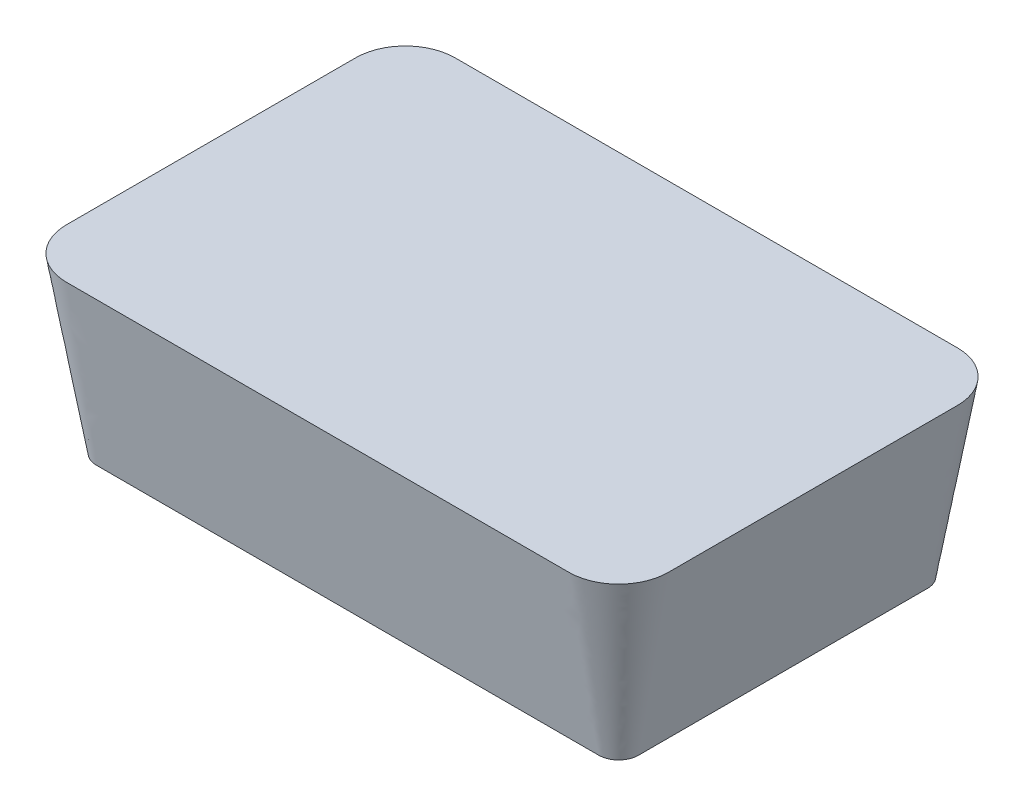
ISO-10303-21;
HEADER;
FILE_DESCRIPTION(('STEP AP214'),'2;1');
FILE_NAME('part.step','',(''),(''),'','','');
FILE_SCHEMA(('AUTOMOTIVE_DESIGN { 1 0 10303 214 1 1 1 1 }'));
ENDSEC;
DATA;
#1=APPLICATION_CONTEXT('core data for automotive mechanical design processes');
#2=APPLICATION_PROTOCOL_DEFINITION('international standard','automotive_design',2000,#1);
#3=PRODUCT_CONTEXT('',#1,'mechanical');
#4=PRODUCT('Part','Part','',(#3));
#5=PRODUCT_RELATED_PRODUCT_CATEGORY('part','',(#4));
#6=PRODUCT_DEFINITION_FORMATION('','',#4);
#7=PRODUCT_DEFINITION_CONTEXT('part definition',#1,'design');
#8=PRODUCT_DEFINITION('design','',#6,#7);
#9=PRODUCT_DEFINITION_SHAPE('','',#8);
#10=(LENGTH_UNIT() NAMED_UNIT(*) SI_UNIT(.MILLI.,.METRE.));
#11=(NAMED_UNIT(*) PLANE_ANGLE_UNIT() SI_UNIT($,.RADIAN.));
#12=(NAMED_UNIT(*) SI_UNIT($,.STERADIAN.) SOLID_ANGLE_UNIT());
#13=UNCERTAINTY_MEASURE_WITH_UNIT(LENGTH_MEASURE(1.E-05),#10,'distance_accuracy_value','');
#14=(GEOMETRIC_REPRESENTATION_CONTEXT(3) GLOBAL_UNCERTAINTY_ASSIGNED_CONTEXT((#13)) GLOBAL_UNIT_ASSIGNED_CONTEXT((#10,
#11,#12)) REPRESENTATION_CONTEXT('',''));
#15=CARTESIAN_POINT('',(0.,0.,0.));
#16=DIRECTION('',(0.,0.,1.));
#17=DIRECTION('',(1.,0.,0.));
#18=AXIS2_PLACEMENT_3D('',#15,#16,#17);
#19=CARTESIAN_POINT('',(160.02,0.,-92.075));
#20=DIRECTION('',(0.,1.,0.));
#21=DIRECTION('',(0.,0.,1.));
#22=AXIS2_PLACEMENT_3D('',#19,#20,#21);
#23=PLANE('',#22);
#24=CARTESIAN_POINT('',(160.02,0.,-92.075));
#25=DIRECTION('',(0.,1.,0.));
#26=DIRECTION('',(0.,0.,1.));
#27=AXIS2_PLACEMENT_3D('',#24,#25,#26);
#28=CIRCLE('',#27,12.7);
#29=CARTESIAN_POINT('',(172.72,0.,-92.0749999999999));
#30=VERTEX_POINT('',#29);
#31=CARTESIAN_POINT('',(160.02,0.,-104.775));
#32=VERTEX_POINT('',#31);
#33=EDGE_CURVE('E313',#30,#32,#28,.T.);
#34=ORIENTED_EDGE('',*,*,#33,.F.);
#35=DIRECTION('',(0.,0.,-1.));
#36=VECTOR('',#35,1.);
#37=CARTESIAN_POINT('',(172.72,0.,92.0749999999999));
#38=LINE('',#37,#36);
#39=CARTESIAN_POINT('',(172.72,0.,92.0749999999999));
#40=VERTEX_POINT('',#39);
#41=EDGE_CURVE('E12',#40,#30,#38,.T.);
#42=ORIENTED_EDGE('',*,*,#41,.F.);
#43=CARTESIAN_POINT('',(160.02,0.,92.075));
#44=DIRECTION('',(0.,1.,0.));
#45=DIRECTION('',(0.,0.,1.));
#46=AXIS2_PLACEMENT_3D('',#43,#44,#45);
#47=CIRCLE('',#46,12.7);
#48=CARTESIAN_POINT('',(160.02,0.,104.775));
#49=VERTEX_POINT('',#48);
#50=EDGE_CURVE('E242',#49,#40,#47,.T.);
#51=ORIENTED_EDGE('',*,*,#50,.F.);
#52=DIRECTION('',(1.,0.,0.));
#53=VECTOR('',#52,1.);
#54=CARTESIAN_POINT('',(160.02,0.,104.775));
#55=LINE('',#54,#53);
#56=CARTESIAN_POINT('',(-160.02,0.,104.775));
#57=VERTEX_POINT('',#56);
#58=EDGE_CURVE('E449',#57,#49,#55,.T.);
#59=ORIENTED_EDGE('',*,*,#58,.F.);
#60=CARTESIAN_POINT('',(-160.02,0.,92.075));
#61=DIRECTION('',(0.,1.,0.));
#62=DIRECTION('',(0.,0.,-1.));
#63=AXIS2_PLACEMENT_3D('',#60,#61,#62);
#64=CIRCLE('',#63,12.7);
#65=CARTESIAN_POINT('',(-172.72,0.,92.0749999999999));
#66=VERTEX_POINT('',#65);
#67=EDGE_CURVE('E460',#66,#57,#64,.T.);
#68=ORIENTED_EDGE('',*,*,#67,.F.);
#69=DIRECTION('',(0.,0.,1.));
#70=VECTOR('',#69,1.);
#71=CARTESIAN_POINT('',(-172.72,0.,92.0749999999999));
#72=LINE('',#71,#70);
#73=CARTESIAN_POINT('',(-172.72,0.,-92.0749999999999));
#74=VERTEX_POINT('',#73);
#75=EDGE_CURVE('E470',#74,#66,#72,.T.);
#76=ORIENTED_EDGE('',*,*,#75,.F.);
#77=CARTESIAN_POINT('',(-160.02,0.,-92.075));
#78=DIRECTION('',(0.,1.,0.));
#79=DIRECTION('',(0.,0.,1.));
#80=AXIS2_PLACEMENT_3D('',#77,#78,#79);
#81=CIRCLE('',#80,12.7);
#82=CARTESIAN_POINT('',(-160.02,0.,-104.775));
#83=VERTEX_POINT('',#82);
#84=EDGE_CURVE('E256',#83,#74,#81,.T.);
#85=ORIENTED_EDGE('',*,*,#84,.F.);
#86=DIRECTION('',(-1.,0.,0.));
#87=VECTOR('',#86,1.);
#88=CARTESIAN_POINT('',(160.02,0.,-104.775));
#89=LINE('',#88,#87);
#90=EDGE_CURVE('E250',#32,#83,#89,.T.);
#91=ORIENTED_EDGE('',*,*,#90,.F.);
#92=EDGE_LOOP('',(#34,#42,#51,#59,#68,#76,#85,#91));
#93=FACE_BOUND('',#92,.T.);
#94=ADVANCED_FACE('F231',(#93),#23,.F.);
#95=CARTESIAN_POINT('',(160.02,110.49,92.075));
#96=DIRECTION('',(0.,1.,0.));
#97=DIRECTION('',(0.,0.,1.));
#98=AXIS2_PLACEMENT_3D('',#95,#96,#97);
#99=PLANE('',#98);
#100=CARTESIAN_POINT('',(160.02,110.49,92.075));
#101=DIRECTION('',(0.,1.,0.));
#102=DIRECTION('',(0.,0.,1.));
#103=AXIS2_PLACEMENT_3D('',#100,#101,#102);
#104=CIRCLE('',#103,31.75);
#105=CARTESIAN_POINT('',(160.02,110.49,123.825));
#106=VERTEX_POINT('',#105);
#107=CARTESIAN_POINT('',(191.77,110.49,92.0749999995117));
#108=VERTEX_POINT('',#107);
#109=EDGE_CURVE('E308',#106,#108,#104,.T.);
#110=ORIENTED_EDGE('',*,*,#109,.T.);
#111=DIRECTION('',(0.,0.,-1.));
#112=VECTOR('',#111,1.);
#113=CARTESIAN_POINT('',(191.77,110.49,92.0749999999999));
#114=LINE('',#113,#112);
#115=CARTESIAN_POINT('',(191.77,110.49,-92.0749999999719));
#116=VERTEX_POINT('',#115);
#117=EDGE_CURVE('E379',#108,#116,#114,.T.);
#118=ORIENTED_EDGE('',*,*,#117,.T.);
#119=CARTESIAN_POINT('',(160.02,110.49,-92.075));
#120=DIRECTION('',(0.,1.,0.));
#121=DIRECTION('',(0.,0.,1.));
#122=AXIS2_PLACEMENT_3D('',#119,#120,#121);
#123=CIRCLE('',#122,31.75);
#124=CARTESIAN_POINT('',(160.020000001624,110.49,-123.825));
#125=VERTEX_POINT('',#124);
#126=EDGE_CURVE('E387',#116,#125,#123,.T.);
#127=ORIENTED_EDGE('',*,*,#126,.T.);
#128=DIRECTION('',(-1.,0.,0.));
#129=VECTOR('',#128,1.);
#130=CARTESIAN_POINT('',(160.02,110.49,-123.825));
#131=LINE('',#130,#129);
#132=CARTESIAN_POINT('',(-160.019999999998,110.49,-123.825));
#133=VERTEX_POINT('',#132);
#134=EDGE_CURVE('E392',#125,#133,#131,.T.);
#135=ORIENTED_EDGE('',*,*,#134,.T.);
#136=CARTESIAN_POINT('',(-160.02,110.49,-92.075));
#137=DIRECTION('',(0.,1.,0.));
#138=DIRECTION('',(0.,0.,1.));
#139=AXIS2_PLACEMENT_3D('',#136,#137,#138);
#140=CIRCLE('',#139,31.75);
#141=CARTESIAN_POINT('',(-191.77,110.49,-92.0749999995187));
#142=VERTEX_POINT('',#141);
#143=EDGE_CURVE('E627',#133,#142,#140,.T.);
#144=ORIENTED_EDGE('',*,*,#143,.T.);
#145=DIRECTION('',(0.,0.,1.));
#146=VECTOR('',#145,1.);
#147=CARTESIAN_POINT('',(-191.77,110.49,-92.0749999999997));
#148=LINE('',#147,#146);
#149=CARTESIAN_POINT('',(-191.77,110.49,92.0749999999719));
#150=VERTEX_POINT('',#149);
#151=EDGE_CURVE('E319',#142,#150,#148,.T.);
#152=ORIENTED_EDGE('',*,*,#151,.T.);
#153=CARTESIAN_POINT('',(-160.02,110.49,92.075));
#154=DIRECTION('',(0.,1.,0.));
#155=DIRECTION('',(0.,0.,1.));
#156=AXIS2_PLACEMENT_3D('',#153,#154,#155);
#157=CIRCLE('',#156,31.75);
#158=CARTESIAN_POINT('',(-160.02,110.49,123.825));
#159=VERTEX_POINT('',#158);
#160=EDGE_CURVE('E304',#150,#159,#157,.T.);
#161=ORIENTED_EDGE('',*,*,#160,.T.);
#162=DIRECTION('',(1.,0.,0.));
#163=VECTOR('',#162,1.);
#164=CARTESIAN_POINT('',(-160.02,110.49,123.825));
#165=LINE('',#164,#163);
#166=EDGE_CURVE('E299',#159,#106,#165,.T.);
#167=ORIENTED_EDGE('',*,*,#166,.T.);
#168=EDGE_LOOP('',(#110,#118,#127,#135,#144,#152,#161,#167));
#169=FACE_BOUND('',#168,.T.);
#170=ADVANCED_FACE('F317',(#169),#99,.T.);
#171=CARTESIAN_POINT('',(191.77,110.49,92.0749999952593));
#172=CARTESIAN_POINT('',(172.72,0.,92.0749999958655));
#173=CARTESIAN_POINT('',(191.77,110.49,92.8373417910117));
#174=CARTESIAN_POINT('',(172.72,0.,92.7398638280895));
#175=CARTESIAN_POINT('',(191.716143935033,110.49,94.4198494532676));
#176=CARTESIAN_POINT('',(172.624183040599,0.,93.8495563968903));
#177=CARTESIAN_POINT('',(191.426848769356,110.49,96.9754798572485));
#178=CARTESIAN_POINT('',(172.34369748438,0.,95.2416114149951));
#179=CARTESIAN_POINT('',(190.882099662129,110.49,99.721375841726));
#180=CARTESIAN_POINT('',(171.962416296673,0.,96.4507089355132));
#181=CARTESIAN_POINT('',(190.017159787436,110.49,102.636329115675));
#182=CARTESIAN_POINT('',(171.504375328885,0.,97.5380126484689));
#183=CARTESIAN_POINT('',(188.767292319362,110.49,105.699131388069));
#184=CARTESIAN_POINT('',(170.977903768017,0.,98.5255682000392));
#185=CARTESIAN_POINT('',(187.074106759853,110.49,108.826216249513));
#186=CARTESIAN_POINT('',(170.38976425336,0.,99.4330387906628));
#187=CARTESIAN_POINT('',(184.9138243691,110.49,111.906253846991));
#188=CARTESIAN_POINT('',(169.741719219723,0.,100.269105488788));
#189=CARTESIAN_POINT('',(182.325526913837,110.49,114.780185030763));
#190=CARTESIAN_POINT('',(169.034508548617,0.,101.041314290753));
#191=CARTESIAN_POINT('',(179.423353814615,110.49,117.301459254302));
#192=CARTESIAN_POINT('',(168.265804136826,0.,101.752923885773));
#193=CARTESIAN_POINT('',(176.360302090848,110.49,119.375837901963));
#194=CARTESIAN_POINT('',(167.432286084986,0.,102.406140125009));
#195=CARTESIAN_POINT('',(173.284945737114,110.49,120.986265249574));
#196=CARTESIAN_POINT('',(166.526005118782,0.,103.000125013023));
#197=CARTESIAN_POINT('',(170.294329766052,110.49,122.168449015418));
#198=CARTESIAN_POINT('',(165.538254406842,0.,103.533144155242));
#199=CARTESIAN_POINT('',(167.457078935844,110.49,122.98564288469));
#200=CARTESIAN_POINT('',(164.448117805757,0.,103.998181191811));
#201=CARTESIAN_POINT('',(164.788306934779,110.49,123.500040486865));
#202=CARTESIAN_POINT('',(163.233466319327,0.,104.387094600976));
#203=CARTESIAN_POINT('',(162.303127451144,110.49,123.773835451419));
#204=CARTESIAN_POINT('',(161.828355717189,0.,104.674813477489));
#205=CARTESIAN_POINT('',(160.762666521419,110.49,123.825));
#206=CARTESIAN_POINT('',(160.702589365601,0.,104.775));
#207=CARTESIAN_POINT('',(132.164600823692,110.49,123.825));
#208=CARTESIAN_POINT('',(134.417931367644,0.,104.775));
#209=CARTESIAN_POINT('',(78.3436852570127,110.49,123.825));
#210=CARTESIAN_POINT('',(81.7109541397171,0.,104.775));
#211=CARTESIAN_POINT('',(0.,110.49,123.825));
#212=CARTESIAN_POINT('',(0.,0.,104.775));
#213=CARTESIAN_POINT('',(-78.3436852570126,110.49,123.825));
#214=CARTESIAN_POINT('',(-81.7109541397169,0.,104.775));
#215=CARTESIAN_POINT('',(-132.164600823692,110.49,123.825));
#216=CARTESIAN_POINT('',(-134.417931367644,0.,104.775));
#217=CARTESIAN_POINT('',(-160.762666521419,110.49,123.825));
#218=CARTESIAN_POINT('',(-160.702589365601,0.,104.775));
#219=CARTESIAN_POINT('',(-162.303127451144,110.49,123.773835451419));
#220=CARTESIAN_POINT('',(-161.828355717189,0.,104.674813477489));
#221=CARTESIAN_POINT('',(-164.788306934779,110.49,123.500040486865));
#222=CARTESIAN_POINT('',(-163.233466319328,0.,104.387094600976));
#223=CARTESIAN_POINT('',(-167.457078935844,110.49,122.98564288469));
#224=CARTESIAN_POINT('',(-164.448117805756,0.,103.998181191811));
#225=CARTESIAN_POINT('',(-170.294329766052,110.49,122.168449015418));
#226=CARTESIAN_POINT('',(-165.538254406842,0.,103.533144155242));
#227=CARTESIAN_POINT('',(-173.284945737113,110.49,120.986265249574));
#228=CARTESIAN_POINT('',(-166.526005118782,0.,103.000125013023));
#229=CARTESIAN_POINT('',(-176.360302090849,110.49,119.375837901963));
#230=CARTESIAN_POINT('',(-167.432286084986,0.,102.406140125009));
#231=CARTESIAN_POINT('',(-179.423353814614,110.49,117.301459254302));
#232=CARTESIAN_POINT('',(-168.265804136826,0.,101.752923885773));
#233=CARTESIAN_POINT('',(-182.325526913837,110.49,114.780185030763));
#234=CARTESIAN_POINT('',(-169.034508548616,0.,101.041314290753));
#235=CARTESIAN_POINT('',(-184.913824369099,110.49,111.906253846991));
#236=CARTESIAN_POINT('',(-169.741719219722,0.,100.269105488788));
#237=CARTESIAN_POINT('',(-187.074106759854,110.49,108.826216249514));
#238=CARTESIAN_POINT('',(-170.389764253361,0.,99.4330387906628));
#239=CARTESIAN_POINT('',(-188.767292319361,110.49,105.699131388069));
#240=CARTESIAN_POINT('',(-170.977903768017,0.,98.5255682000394));
#241=CARTESIAN_POINT('',(-190.017159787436,110.49,102.636329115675));
#242=CARTESIAN_POINT('',(-171.504375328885,0.,97.5380126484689));
#243=CARTESIAN_POINT('',(-190.882099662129,110.49,99.7213758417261));
#244=CARTESIAN_POINT('',(-171.962416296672,0.,96.4507089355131));
#245=CARTESIAN_POINT('',(-191.426848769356,110.49,96.9754798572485));
#246=CARTESIAN_POINT('',(-172.34369748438,0.,95.2416114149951));
#247=CARTESIAN_POINT('',(-191.716143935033,110.49,94.4198494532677));
#248=CARTESIAN_POINT('',(-172.624183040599,0.,93.8495563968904));
#249=CARTESIAN_POINT('',(-191.77,110.49,92.8373417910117));
#250=CARTESIAN_POINT('',(-172.72,0.,92.7398638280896));
#251=CARTESIAN_POINT('',(-191.77,110.49,75.6224685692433));
#252=CARTESIAN_POINT('',(-172.72,0.,77.7261958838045));
#253=CARTESIAN_POINT('',(-191.77,110.49,44.5422517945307));
#254=CARTESIAN_POINT('',(-172.72,0.,47.6872825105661));
#255=CARTESIAN_POINT('',(-191.77,110.49,1.2490009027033E-13));
#256=CARTESIAN_POINT('',(-172.72,0.,0.));
#257=CARTESIAN_POINT('',(-191.77,110.49,-44.5422517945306));
#258=CARTESIAN_POINT('',(-172.72,0.,-47.6872825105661));
#259=CARTESIAN_POINT('',(-191.77,110.49,-75.6224685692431));
#260=CARTESIAN_POINT('',(-172.72,0.,-77.7261958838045));
#261=CARTESIAN_POINT('',(-191.77,110.49,-92.8373417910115));
#262=CARTESIAN_POINT('',(-172.72,0.,-92.7398638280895));
#263=CARTESIAN_POINT('',(-191.716143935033,110.49,-94.4198494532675));
#264=CARTESIAN_POINT('',(-172.624183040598,0.,-93.8495563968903));
#265=CARTESIAN_POINT('',(-191.426848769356,110.49,-96.9754798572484));
#266=CARTESIAN_POINT('',(-172.34369748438,0.,-95.2416114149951));
#267=CARTESIAN_POINT('',(-190.882099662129,110.49,-99.7213758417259));
#268=CARTESIAN_POINT('',(-171.962416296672,0.,-96.4507089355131));
#269=CARTESIAN_POINT('',(-190.017159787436,110.49,-102.636329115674));
#270=CARTESIAN_POINT('',(-171.504375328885,0.,-97.5380126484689));
#271=CARTESIAN_POINT('',(-188.767292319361,110.49,-105.699131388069));
#272=CARTESIAN_POINT('',(-170.977903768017,0.,-98.5255682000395));
#273=CARTESIAN_POINT('',(-187.074106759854,110.49,-108.826216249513));
#274=CARTESIAN_POINT('',(-170.38976425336,0.,-99.4330387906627));
#275=CARTESIAN_POINT('',(-184.9138243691,110.49,-111.906253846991));
#276=CARTESIAN_POINT('',(-169.741719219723,0.,-100.269105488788));
#277=CARTESIAN_POINT('',(-182.325526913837,110.49,-114.780185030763));
#278=CARTESIAN_POINT('',(-169.034508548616,0.,-101.041314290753));
#279=CARTESIAN_POINT('',(-179.423353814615,110.49,-117.301459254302));
#280=CARTESIAN_POINT('',(-168.265804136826,0.,-101.752923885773));
#281=CARTESIAN_POINT('',(-176.360302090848,110.49,-119.375837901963));
#282=CARTESIAN_POINT('',(-167.432286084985,0.,-102.406140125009));
#283=CARTESIAN_POINT('',(-173.284945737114,110.49,-120.986265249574));
#284=CARTESIAN_POINT('',(-166.526005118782,0.,-103.000125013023));
#285=CARTESIAN_POINT('',(-170.294329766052,110.49,-122.168449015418));
#286=CARTESIAN_POINT('',(-165.538254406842,0.,-103.533144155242));
#287=CARTESIAN_POINT('',(-167.457078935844,110.49,-122.98564288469));
#288=CARTESIAN_POINT('',(-164.448117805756,0.,-103.998181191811));
#289=CARTESIAN_POINT('',(-164.788306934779,110.49,-123.500040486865));
#290=CARTESIAN_POINT('',(-163.233466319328,0.,-104.387094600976));
#291=CARTESIAN_POINT('',(-162.303127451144,110.49,-123.773835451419));
#292=CARTESIAN_POINT('',(-161.828355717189,0.,-104.674813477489));
#293=CARTESIAN_POINT('',(-160.762666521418,110.49,-123.825));
#294=CARTESIAN_POINT('',(-160.702589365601,0.,-104.775));
#295=CARTESIAN_POINT('',(-132.164600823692,110.49,-123.825));
#296=CARTESIAN_POINT('',(-134.417931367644,0.,-104.775));
#297=CARTESIAN_POINT('',(-78.3436852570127,110.49,-123.825));
#298=CARTESIAN_POINT('',(-81.7109541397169,0.,-104.775));
#299=CARTESIAN_POINT('',(-1.17961196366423E-13,110.49,-123.825));
#300=CARTESIAN_POINT('',(1.17961196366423E-13,0.,-104.775));
#301=CARTESIAN_POINT('',(78.3436852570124,110.49,-123.825));
#302=CARTESIAN_POINT('',(81.7109541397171,0.,-104.775));
#303=CARTESIAN_POINT('',(132.164600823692,110.49,-123.825));
#304=CARTESIAN_POINT('',(134.417931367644,0.,-104.775));
#305=CARTESIAN_POINT('',(160.762666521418,110.49,-123.825));
#306=CARTESIAN_POINT('',(160.702589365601,0.,-104.775));
#307=CARTESIAN_POINT('',(162.303127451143,110.49,-123.773835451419));
#308=CARTESIAN_POINT('',(161.828355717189,0.,-104.674813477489));
#309=CARTESIAN_POINT('',(164.788306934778,110.49,-123.500040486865));
#310=CARTESIAN_POINT('',(163.233466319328,0.,-104.387094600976));
#311=CARTESIAN_POINT('',(167.457078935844,110.49,-122.98564288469));
#312=CARTESIAN_POINT('',(164.448117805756,0.,-103.998181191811));
#313=CARTESIAN_POINT('',(170.294329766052,110.49,-122.168449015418));
#314=CARTESIAN_POINT('',(165.538254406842,0.,-103.533144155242));
#315=CARTESIAN_POINT('',(173.284945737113,110.49,-120.986265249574));
#316=CARTESIAN_POINT('',(166.526005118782,0.,-103.000125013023));
#317=CARTESIAN_POINT('',(176.360302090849,110.49,-119.375837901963));
#318=CARTESIAN_POINT('',(167.432286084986,0.,-102.406140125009));
#319=CARTESIAN_POINT('',(179.423353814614,110.49,-117.301459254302));
#320=CARTESIAN_POINT('',(168.265804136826,0.,-101.752923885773));
#321=CARTESIAN_POINT('',(182.325526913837,110.49,-114.780185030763));
#322=CARTESIAN_POINT('',(169.034508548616,0.,-101.041314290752));
#323=CARTESIAN_POINT('',(184.913824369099,110.49,-111.906253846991));
#324=CARTESIAN_POINT('',(169.741719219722,0.,-100.269105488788));
#325=CARTESIAN_POINT('',(187.074106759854,110.49,-108.826216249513));
#326=CARTESIAN_POINT('',(170.389764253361,0.,-99.4330387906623));
#327=CARTESIAN_POINT('',(188.767292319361,110.49,-105.699131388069));
#328=CARTESIAN_POINT('',(170.977903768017,0.,-98.5255682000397));
#329=CARTESIAN_POINT('',(190.017159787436,110.49,-102.636329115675));
#330=CARTESIAN_POINT('',(171.504375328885,0.,-97.5380126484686));
#331=CARTESIAN_POINT('',(190.882099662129,110.49,-99.721375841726));
#332=CARTESIAN_POINT('',(171.962416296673,0.,-96.4507089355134));
#333=CARTESIAN_POINT('',(191.426848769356,110.49,-96.9754798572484));
#334=CARTESIAN_POINT('',(172.34369748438,0.,-95.2416114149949));
#335=CARTESIAN_POINT('',(191.716143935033,110.49,-94.4198494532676));
#336=CARTESIAN_POINT('',(172.624183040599,0.,-93.8495563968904));
#337=CARTESIAN_POINT('',(191.77,110.49,-92.8373417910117));
#338=CARTESIAN_POINT('',(172.72,0.,-92.7398638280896));
#339=CARTESIAN_POINT('',(191.77,110.49,-75.6224685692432));
#340=CARTESIAN_POINT('',(172.72,0.,-77.7261958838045));
#341=CARTESIAN_POINT('',(191.77,110.49,-44.5422517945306));
#342=CARTESIAN_POINT('',(172.72,0.,-47.6872825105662));
#343=CARTESIAN_POINT('',(191.77,110.49,0.));
#344=CARTESIAN_POINT('',(172.72,0.,0.));
#345=CARTESIAN_POINT('',(191.77,110.49,44.5422517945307));
#346=CARTESIAN_POINT('',(172.72,0.,47.687282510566));
#347=CARTESIAN_POINT('',(191.77,110.49,75.6224685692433));
#348=CARTESIAN_POINT('',(172.72,0.,77.7261958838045));
#349=CARTESIAN_POINT('',(191.77,110.49,92.0749999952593));
#350=CARTESIAN_POINT('',(172.72,0.,92.0749999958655));
#351=B_SPLINE_SURFACE_WITH_KNOTS('',3,1,((#171,#172),(#173,#174),(#175,#176),(#177,#178),(#179,
#180),(#181,#182),(#183,#184),(#185,#186),(#187,#188),(#189,#190),(#191,#192),(#193,#194),(#195,
#196),(#197,#198),(#199,#200),(#201,#202),(#203,#204),(#205,#206),(#207,#208),(#209,#210),(#211,
#212),(#213,#214),(#215,#216),(#217,#218),(#219,#220),(#221,#222),(#223,#224),(#225,#226),(#227,
#228),(#229,#230),(#231,#232),(#233,#234),(#235,#236),(#237,#238),(#239,#240),(#241,#242),(#243,
#244),(#245,#246),(#247,#248),(#249,#250),(#251,#252),(#253,#254),(#255,#256),(#257,#258),(#259,
#260),(#261,#262),(#263,#264),(#265,#266),(#267,#268),(#269,#270),(#271,#272),(#273,#274),(#275,
#276),(#277,#278),(#279,#280),(#281,#282),(#283,#284),(#285,#286),(#287,#288),(#289,#290),(#291,
#292),(#293,#294),(#295,#296),(#297,#298),(#299,#300),(#301,#302),(#303,#304),(#305,#306),(#307,
#308),(#309,#310),(#311,#312),(#313,#314),(#315,#316),(#317,#318),(#319,#320),(#321,#322),(#323,
#324),(#325,#326),(#327,#328),(#329,#330),(#331,#332),(#333,#334),(#335,#336),(#337,#338),(#339,
#340),(#341,#342),(#343,#344),(#345,#346),(#347,#348),(#349,#350)),.UNSPECIFIED.,.T.,.F.,.F.,(4,
1,1,1,1,1,1,1,1,1,1,1,1,1,1,1,2,1,1,1,2,1,1,1,1,1,1,1,1,1,1,1,1,1,1,1,2,1,1,1,2,1,1,1,1,1,1,1,1,
1,1,1,1,1,1,1,2,1,1,1,2,1,1,1,1,1,1,1,1,1,1,1,1,1,1,1,2,1,1,1,4),(2,2),(0.,0.00186320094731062,
0.00372640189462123,0.00558960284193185,0.00745280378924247,0.00931600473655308,
0.0111792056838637,0.0130424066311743,0.0149056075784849,0.0167688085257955,0.0186320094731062,
0.0204952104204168,0.0223584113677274,0.024221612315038,0.0260848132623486,0.0279480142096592,
0.0298112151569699,0.0996948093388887,0.169578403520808,0.239461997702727,0.309345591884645,
0.311208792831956,0.313071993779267,0.314935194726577,0.316798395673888,0.318661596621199,
0.320524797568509,0.32238799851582,0.32425119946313,0.326114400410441,0.327977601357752,
0.329840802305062,0.331704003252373,0.333567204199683,0.335430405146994,0.337293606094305,
0.339156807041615,0.379367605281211,0.419578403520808,0.459789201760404,0.5,0.501863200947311,
0.503726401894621,0.505589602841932,0.507452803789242,0.509316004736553,0.511179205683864,
0.513042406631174,0.514905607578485,0.516768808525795,0.518632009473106,0.520495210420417,
0.522358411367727,0.524221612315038,0.526084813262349,0.527948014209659,0.52981121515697,
0.599694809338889,0.669578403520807,0.739461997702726,0.809345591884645,0.811208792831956,
0.813071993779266,0.814935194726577,0.816798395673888,0.818661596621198,0.820524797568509,
0.82238799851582,0.82425119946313,0.826114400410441,0.827977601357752,0.829840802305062,
0.831704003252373,0.833567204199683,0.835430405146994,0.837293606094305,0.839156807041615,
0.879367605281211,0.919578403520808,0.959789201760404,1.),(0.,1.),.UNSPECIFIED.);
#352=CARTESIAN_POINT('',(0.,110.49,123.825));
#353=CARTESIAN_POINT('',(0.,0.,104.775));
#354=CARTESIAN_POINT('',(-26.1145617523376,110.49,123.825));
#355=CARTESIAN_POINT('',(-27.2369847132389,0.,104.775));
#356=CARTESIAN_POINT('',(-78.3436852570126,110.49,123.825));
#357=CARTESIAN_POINT('',(-81.7109541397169,0.,104.775));
#358=CARTESIAN_POINT('',(-132.164600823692,110.49,123.825));
#359=CARTESIAN_POINT('',(-134.417931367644,0.,104.775));
#360=CARTESIAN_POINT('',(-160.762666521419,110.49,123.825));
#361=CARTESIAN_POINT('',(-160.702589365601,0.,104.775));
#362=CARTESIAN_POINT('',(-162.303127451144,110.49,123.773835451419));
#363=CARTESIAN_POINT('',(-161.828355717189,0.,104.674813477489));
#364=CARTESIAN_POINT('',(-164.788306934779,110.49,123.500040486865));
#365=CARTESIAN_POINT('',(-163.233466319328,0.,104.387094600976));
#366=CARTESIAN_POINT('',(-167.457078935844,110.49,122.98564288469));
#367=CARTESIAN_POINT('',(-164.448117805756,0.,103.998181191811));
#368=CARTESIAN_POINT('',(-170.294329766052,110.49,122.168449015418));
#369=CARTESIAN_POINT('',(-165.538254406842,0.,103.533144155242));
#370=CARTESIAN_POINT('',(-173.284945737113,110.49,120.986265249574));
#371=CARTESIAN_POINT('',(-166.526005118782,0.,103.000125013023));
#372=CARTESIAN_POINT('',(-176.360302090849,110.49,119.375837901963));
#373=CARTESIAN_POINT('',(-167.432286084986,0.,102.406140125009));
#374=CARTESIAN_POINT('',(-179.423353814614,110.49,117.301459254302));
#375=CARTESIAN_POINT('',(-168.265804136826,0.,101.752923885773));
#376=CARTESIAN_POINT('',(-182.325526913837,110.49,114.780185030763));
#377=CARTESIAN_POINT('',(-169.034508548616,0.,101.041314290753));
#378=CARTESIAN_POINT('',(-184.913824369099,110.49,111.906253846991));
#379=CARTESIAN_POINT('',(-169.741719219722,0.,100.269105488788));
#380=CARTESIAN_POINT('',(-187.074106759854,110.49,108.826216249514));
#381=CARTESIAN_POINT('',(-170.389764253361,0.,99.4330387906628));
#382=CARTESIAN_POINT('',(-188.767292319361,110.49,105.699131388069));
#383=CARTESIAN_POINT('',(-170.977903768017,0.,98.5255682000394));
#384=CARTESIAN_POINT('',(-190.017159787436,110.49,102.636329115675));
#385=CARTESIAN_POINT('',(-171.504375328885,0.,97.5380126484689));
#386=CARTESIAN_POINT('',(-190.882099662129,110.49,99.7213758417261));
#387=CARTESIAN_POINT('',(-171.962416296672,0.,96.4507089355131));
#388=CARTESIAN_POINT('',(-191.426848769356,110.49,96.9754798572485));
#389=CARTESIAN_POINT('',(-172.34369748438,0.,95.2416114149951));
#390=CARTESIAN_POINT('',(-191.716143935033,110.49,94.4198494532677));
#391=CARTESIAN_POINT('',(-172.624183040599,0.,93.8495563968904));
#392=CARTESIAN_POINT('',(-191.77,110.49,92.8373417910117));
#393=CARTESIAN_POINT('',(-172.72,0.,92.7398638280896));
#394=CARTESIAN_POINT('',(-191.77,110.49,75.6224685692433));
#395=CARTESIAN_POINT('',(-172.72,0.,77.7261958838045));
#396=CARTESIAN_POINT('',(-191.77,110.49,44.5422517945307));
#397=CARTESIAN_POINT('',(-172.72,0.,47.6872825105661));
#398=CARTESIAN_POINT('',(-191.77,110.49,1.2490009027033E-13));
#399=CARTESIAN_POINT('',(-172.72,0.,0.));
#400=CARTESIAN_POINT('',(-191.77,110.49,-44.5422517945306));
#401=CARTESIAN_POINT('',(-172.72,0.,-47.6872825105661));
#402=CARTESIAN_POINT('',(-191.77,110.49,-75.6224685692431));
#403=CARTESIAN_POINT('',(-172.72,0.,-77.7261958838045));
#404=CARTESIAN_POINT('',(-191.77,110.49,-92.8373417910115));
#405=CARTESIAN_POINT('',(-172.72,0.,-92.7398638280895));
#406=CARTESIAN_POINT('',(-191.716143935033,110.49,-94.4198494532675));
#407=CARTESIAN_POINT('',(-172.624183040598,0.,-93.8495563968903));
#408=CARTESIAN_POINT('',(-191.426848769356,110.49,-96.9754798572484));
#409=CARTESIAN_POINT('',(-172.34369748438,0.,-95.2416114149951));
#410=CARTESIAN_POINT('',(-190.882099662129,110.49,-99.7213758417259));
#411=CARTESIAN_POINT('',(-171.962416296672,0.,-96.4507089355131));
#412=CARTESIAN_POINT('',(-190.017159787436,110.49,-102.636329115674));
#413=CARTESIAN_POINT('',(-171.504375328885,0.,-97.5380126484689));
#414=CARTESIAN_POINT('',(-188.767292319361,110.49,-105.699131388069));
#415=CARTESIAN_POINT('',(-170.977903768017,0.,-98.5255682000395));
#416=CARTESIAN_POINT('',(-187.074106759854,110.49,-108.826216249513));
#417=CARTESIAN_POINT('',(-170.38976425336,0.,-99.4330387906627));
#418=CARTESIAN_POINT('',(-184.9138243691,110.49,-111.906253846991));
#419=CARTESIAN_POINT('',(-169.741719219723,0.,-100.269105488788));
#420=CARTESIAN_POINT('',(-182.325526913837,110.49,-114.780185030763));
#421=CARTESIAN_POINT('',(-169.034508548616,0.,-101.041314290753));
#422=CARTESIAN_POINT('',(-179.423353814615,110.49,-117.301459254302));
#423=CARTESIAN_POINT('',(-168.265804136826,0.,-101.752923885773));
#424=CARTESIAN_POINT('',(-176.360302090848,110.49,-119.375837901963));
#425=CARTESIAN_POINT('',(-167.432286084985,0.,-102.406140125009));
#426=CARTESIAN_POINT('',(-173.284945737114,110.49,-120.986265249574));
#427=CARTESIAN_POINT('',(-166.526005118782,0.,-103.000125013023));
#428=CARTESIAN_POINT('',(-170.294329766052,110.49,-122.168449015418));
#429=CARTESIAN_POINT('',(-165.538254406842,0.,-103.533144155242));
#430=CARTESIAN_POINT('',(-167.457078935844,110.49,-122.98564288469));
#431=CARTESIAN_POINT('',(-164.448117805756,0.,-103.998181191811));
#432=CARTESIAN_POINT('',(-164.788306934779,110.49,-123.500040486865));
#433=CARTESIAN_POINT('',(-163.233466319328,0.,-104.387094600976));
#434=CARTESIAN_POINT('',(-162.303127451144,110.49,-123.773835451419));
#435=CARTESIAN_POINT('',(-161.828355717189,0.,-104.674813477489));
#436=CARTESIAN_POINT('',(-160.762666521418,110.49,-123.825));
#437=CARTESIAN_POINT('',(-160.702589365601,0.,-104.775));
#438=CARTESIAN_POINT('',(-132.164600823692,110.49,-123.825));
#439=CARTESIAN_POINT('',(-134.417931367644,0.,-104.775));
#440=CARTESIAN_POINT('',(-78.3436852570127,110.49,-123.825));
#441=CARTESIAN_POINT('',(-81.7109541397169,0.,-104.775));
#442=CARTESIAN_POINT('',(-1.17961196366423E-13,110.49,-123.825));
#443=CARTESIAN_POINT('',(1.17961196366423E-13,0.,-104.775));
#444=CARTESIAN_POINT('',(78.3436852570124,110.49,-123.825));
#445=CARTESIAN_POINT('',(81.7109541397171,0.,-104.775));
#446=CARTESIAN_POINT('',(132.164600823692,110.49,-123.825));
#447=CARTESIAN_POINT('',(134.417931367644,0.,-104.775));
#448=CARTESIAN_POINT('',(160.762666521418,110.49,-123.825));
#449=CARTESIAN_POINT('',(160.702589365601,0.,-104.775));
#450=CARTESIAN_POINT('',(162.303127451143,110.49,-123.773835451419));
#451=CARTESIAN_POINT('',(161.828355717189,0.,-104.674813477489));
#452=CARTESIAN_POINT('',(164.788306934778,110.49,-123.500040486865));
#453=CARTESIAN_POINT('',(163.233466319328,0.,-104.387094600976));
#454=CARTESIAN_POINT('',(167.457078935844,110.49,-122.98564288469));
#455=CARTESIAN_POINT('',(164.448117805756,0.,-103.998181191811));
#456=CARTESIAN_POINT('',(170.294329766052,110.49,-122.168449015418));
#457=CARTESIAN_POINT('',(165.538254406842,0.,-103.533144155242));
#458=CARTESIAN_POINT('',(173.284945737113,110.49,-120.986265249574));
#459=CARTESIAN_POINT('',(166.526005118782,0.,-103.000125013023));
#460=CARTESIAN_POINT('',(176.360302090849,110.49,-119.375837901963));
#461=CARTESIAN_POINT('',(167.432286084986,0.,-102.406140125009));
#462=CARTESIAN_POINT('',(179.423353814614,110.49,-117.301459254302));
#463=CARTESIAN_POINT('',(168.265804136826,0.,-101.752923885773));
#464=CARTESIAN_POINT('',(182.325526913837,110.49,-114.780185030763));
#465=CARTESIAN_POINT('',(169.034508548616,0.,-101.041314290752));
#466=CARTESIAN_POINT('',(184.913824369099,110.49,-111.906253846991));
#467=CARTESIAN_POINT('',(169.741719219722,0.,-100.269105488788));
#468=CARTESIAN_POINT('',(187.074106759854,110.49,-108.826216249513));
#469=CARTESIAN_POINT('',(170.389764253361,0.,-99.4330387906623));
#470=CARTESIAN_POINT('',(188.767292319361,110.49,-105.699131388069));
#471=CARTESIAN_POINT('',(170.977903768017,0.,-98.5255682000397));
#472=CARTESIAN_POINT('',(190.017159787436,110.49,-102.636329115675));
#473=CARTESIAN_POINT('',(171.504375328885,0.,-97.5380126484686));
#474=CARTESIAN_POINT('',(190.882099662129,110.49,-99.721375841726));
#475=CARTESIAN_POINT('',(171.962416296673,0.,-96.4507089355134));
#476=CARTESIAN_POINT('',(191.426848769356,110.49,-96.9754798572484));
#477=CARTESIAN_POINT('',(172.34369748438,0.,-95.2416114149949));
#478=CARTESIAN_POINT('',(191.716143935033,110.49,-94.4198494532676));
#479=CARTESIAN_POINT('',(172.624183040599,0.,-93.8495563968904));
#480=CARTESIAN_POINT('',(191.77,110.49,-92.8373417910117));
#481=CARTESIAN_POINT('',(172.72,0.,-92.7398638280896));
#482=CARTESIAN_POINT('',(191.77,110.49,-75.6224685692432));
#483=CARTESIAN_POINT('',(172.72,0.,-77.7261958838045));
#484=CARTESIAN_POINT('',(191.77,110.49,-44.5422517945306));
#485=CARTESIAN_POINT('',(172.72,0.,-47.6872825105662));
#486=CARTESIAN_POINT('',(191.77,110.49,0.));
#487=CARTESIAN_POINT('',(172.72,0.,0.));
#488=CARTESIAN_POINT('',(191.77,110.49,44.5422517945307));
#489=CARTESIAN_POINT('',(172.72,0.,47.687282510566));
#490=CARTESIAN_POINT('',(191.77,110.49,75.6224685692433));
#491=CARTESIAN_POINT('',(172.72,0.,77.7261958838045));
#492=CARTESIAN_POINT('',(191.77,110.49,92.8373417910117));
#493=CARTESIAN_POINT('',(172.72,0.,92.7398638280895));
#494=CARTESIAN_POINT('',(191.716143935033,110.49,94.4198494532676));
#495=CARTESIAN_POINT('',(172.624183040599,0.,93.8495563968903));
#496=CARTESIAN_POINT('',(191.426848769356,110.49,96.9754798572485));
#497=CARTESIAN_POINT('',(172.34369748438,0.,95.2416114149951));
#498=CARTESIAN_POINT('',(190.882099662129,110.49,99.721375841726));
#499=CARTESIAN_POINT('',(171.962416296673,0.,96.4507089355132));
#500=CARTESIAN_POINT('',(190.017159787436,110.49,102.636329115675));
#501=CARTESIAN_POINT('',(171.504375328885,0.,97.5380126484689));
#502=CARTESIAN_POINT('',(188.767292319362,110.49,105.699131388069));
#503=CARTESIAN_POINT('',(170.977903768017,0.,98.5255682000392));
#504=CARTESIAN_POINT('',(187.074106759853,110.49,108.826216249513));
#505=CARTESIAN_POINT('',(170.38976425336,0.,99.4330387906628));
#506=CARTESIAN_POINT('',(184.9138243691,110.49,111.906253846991));
#507=CARTESIAN_POINT('',(169.741719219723,0.,100.269105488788));
#508=CARTESIAN_POINT('',(182.325526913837,110.49,114.780185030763));
#509=CARTESIAN_POINT('',(169.034508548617,0.,101.041314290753));
#510=CARTESIAN_POINT('',(179.423353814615,110.49,117.301459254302));
#511=CARTESIAN_POINT('',(168.265804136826,0.,101.752923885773));
#512=CARTESIAN_POINT('',(176.360302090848,110.49,119.375837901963));
#513=CARTESIAN_POINT('',(167.432286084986,0.,102.406140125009));
#514=CARTESIAN_POINT('',(173.284945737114,110.49,120.986265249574));
#515=CARTESIAN_POINT('',(166.526005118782,0.,103.000125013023));
#516=CARTESIAN_POINT('',(170.294329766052,110.49,122.168449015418));
#517=CARTESIAN_POINT('',(165.538254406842,0.,103.533144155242));
#518=CARTESIAN_POINT('',(167.457078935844,110.49,122.98564288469));
#519=CARTESIAN_POINT('',(164.448117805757,0.,103.998181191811));
#520=CARTESIAN_POINT('',(164.788306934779,110.49,123.500040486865));
#521=CARTESIAN_POINT('',(163.233466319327,0.,104.387094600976));
#522=CARTESIAN_POINT('',(162.303127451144,110.49,123.773835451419));
#523=CARTESIAN_POINT('',(161.828355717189,0.,104.674813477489));
#524=CARTESIAN_POINT('',(160.762666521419,110.49,123.825));
#525=CARTESIAN_POINT('',(160.702589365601,0.,104.775));
#526=CARTESIAN_POINT('',(132.164600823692,110.49,123.825));
#527=CARTESIAN_POINT('',(134.417931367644,0.,104.775));
#528=CARTESIAN_POINT('',(78.3436852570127,110.49,123.825));
#529=CARTESIAN_POINT('',(81.7109541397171,0.,104.775));
#530=CARTESIAN_POINT('',(26.1145617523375,110.49,123.825));
#531=CARTESIAN_POINT('',(27.2369847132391,0.,104.775));
#532=CARTESIAN_POINT('',(0.,110.49,123.825));
#533=CARTESIAN_POINT('',(0.,0.,104.775));
#534=B_SPLINE_SURFACE_WITH_KNOTS('',3,1,((#352,#353),(#354,#355),(#356,#357),(#358,#359),(#360,
#361),(#362,#363),(#364,#365),(#366,#367),(#368,#369),(#370,#371),(#372,#373),(#374,#375),(#376,
#377),(#378,#379),(#380,#381),(#382,#383),(#384,#385),(#386,#387),(#388,#389),(#390,#391),(#392,
#393),(#394,#395),(#396,#397),(#398,#399),(#400,#401),(#402,#403),(#404,#405),(#406,#407),(#408,
#409),(#410,#411),(#412,#413),(#414,#415),(#416,#417),(#418,#419),(#420,#421),(#422,#423),(#424,
#425),(#426,#427),(#428,#429),(#430,#431),(#432,#433),(#434,#435),(#436,#437),(#438,#439),(#440,
#441),(#442,#443),(#444,#445),(#446,#447),(#448,#449),(#450,#451),(#452,#453),(#454,#455),(#456,
#457),(#458,#459),(#460,#461),(#462,#463),(#464,#465),(#466,#467),(#468,#469),(#470,#471),(#472,
#473),(#474,#475),(#476,#477),(#478,#479),(#480,#481),(#482,#483),(#484,#485),(#486,#487),(#488,
#489),(#490,#491),(#492,#493),(#494,#495),(#496,#497),(#498,#499),(#500,#501),(#502,#503),(#504,
#505),(#506,#507),(#508,#509),(#510,#511),(#512,#513),(#514,#515),(#516,#517),(#518,#519),(#520,
#521),(#522,#523),(#524,#525),(#526,#527),(#528,#529),(#530,#531),(#532,#533)),.UNSPECIFIED.,
.T.,.F.,.F.,(4,1,2,1,1,1,1,1,1,1,1,1,1,1,1,1,1,1,2,1,1,1,2,1,1,1,1,1,1,1,1,1,1,1,1,1,1,1,2,1,1,
1,2,1,1,1,1,1,1,1,1,1,1,1,1,1,1,1,2,1,1,1,2,1,1,1,1,1,1,1,1,1,1,1,1,1,1,1,2,1,4),(2,2),
(0.169578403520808,0.239461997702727,0.309345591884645,0.311208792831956,0.313071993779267,
0.314935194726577,0.316798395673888,0.318661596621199,0.320524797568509,0.32238799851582,
0.32425119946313,0.326114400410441,0.327977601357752,0.329840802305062,0.331704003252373,
0.333567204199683,0.335430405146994,0.337293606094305,0.339156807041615,0.379367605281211,
0.419578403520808,0.459789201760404,0.5,0.501863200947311,0.503726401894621,0.505589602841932,
0.507452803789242,0.509316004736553,0.511179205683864,0.513042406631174,0.514905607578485,
0.516768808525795,0.518632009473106,0.520495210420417,0.522358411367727,0.524221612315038,
0.526084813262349,0.527948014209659,0.52981121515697,0.599694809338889,0.669578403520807,
0.739461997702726,0.809345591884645,0.811208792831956,0.813071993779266,0.814935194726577,
0.816798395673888,0.818661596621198,0.820524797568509,0.82238799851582,0.82425119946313,
0.826114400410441,0.827977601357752,0.829840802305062,0.831704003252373,0.833567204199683,
0.835430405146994,0.837293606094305,0.839156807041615,0.879367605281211,0.919578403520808,
0.959789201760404,1.,1.00186320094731,1.00372640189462,1.00558960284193,1.00745280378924,
1.00931600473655,1.01117920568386,1.01304240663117,1.01490560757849,1.0167688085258,
1.01863200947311,1.02049521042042,1.02235841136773,1.02422161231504,1.02608481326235,
1.02794801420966,1.02981121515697,1.09969480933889,1.16957840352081),(0.,1.),.UNSPECIFIED.);
#535=ORIENTED_EDGE('',*,*,#160,.F.);
#536=ORIENTED_EDGE('',*,*,#151,.F.);
#537=ORIENTED_EDGE('',*,*,#143,.F.);
#538=ORIENTED_EDGE('',*,*,#134,.F.);
#539=ORIENTED_EDGE('',*,*,#126,.F.);
#540=ORIENTED_EDGE('',*,*,#117,.F.);
#541=ORIENTED_EDGE('',*,*,#109,.F.);
#542=ORIENTED_EDGE('',*,*,#166,.F.);
#543=EDGE_LOOP('',(#535,#536,#537,#538,#539,#540,#541,#542));
#544=FACE_BOUND('',#543,.T.);
#545=ORIENTED_EDGE('',*,*,#41,.T.);
#546=ORIENTED_EDGE('',*,*,#33,.T.);
#547=ORIENTED_EDGE('',*,*,#90,.T.);
#548=ORIENTED_EDGE('',*,*,#84,.T.);
#549=ORIENTED_EDGE('',*,*,#75,.T.);
#550=ORIENTED_EDGE('',*,*,#67,.T.);
#551=ORIENTED_EDGE('',*,*,#58,.T.);
#552=ORIENTED_EDGE('',*,*,#50,.T.);
#553=EDGE_LOOP('',(#545,#546,#547,#548,#549,#550,#551,#552));
#554=FACE_BOUND('',#553,.T.);
#555=ADVANCED_FACE('F302',(#544,#554),#534,.T.);
#556=CLOSED_SHELL('',(#94,#170,#555));
#557=MANIFOLD_SOLID_BREP('B2',#556);
#558=ADVANCED_BREP_SHAPE_REPRESENTATION('',(#18,#557),#14);
#559=SHAPE_DEFINITION_REPRESENTATION(#9,#558);
ENDSEC;
END-ISO-10303-21;
